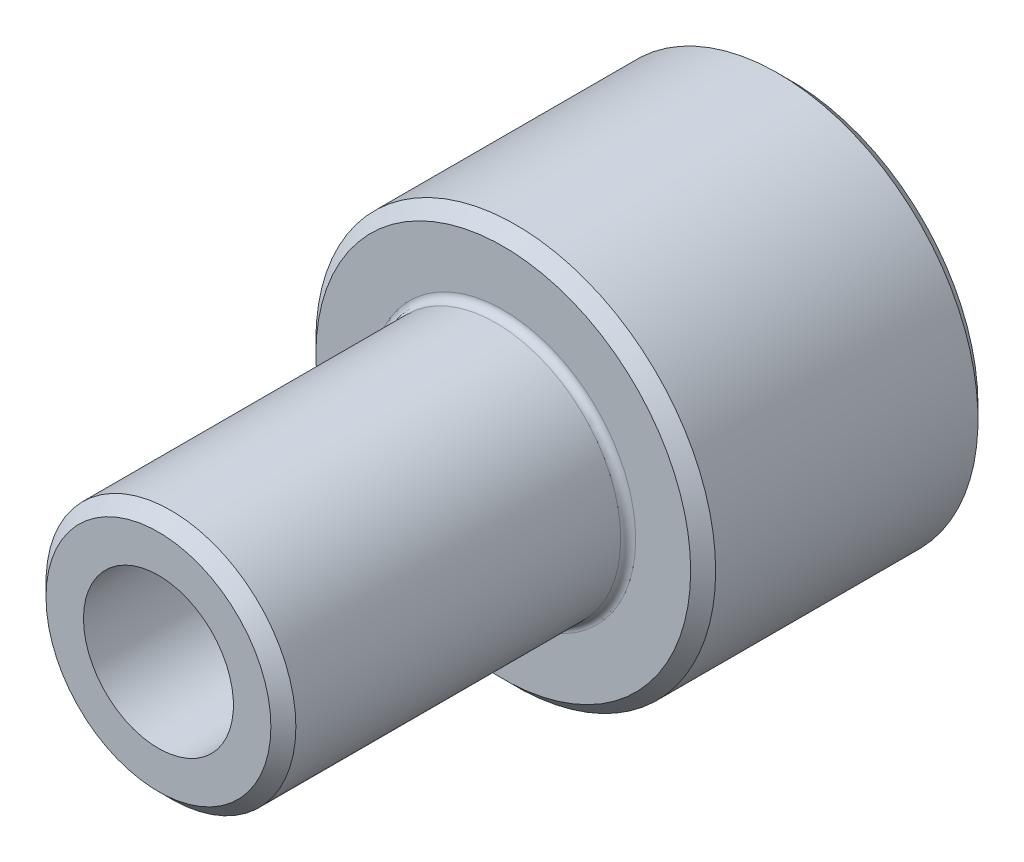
ISO-10303-21;
HEADER;
FILE_DESCRIPTION(('STEP AP214'),'2;1');
FILE_NAME('part.step','',(''),(''),'','','');
FILE_SCHEMA(('AUTOMOTIVE_DESIGN { 1 0 10303 214 1 1 1 1 }'));
ENDSEC;
DATA;
#1=APPLICATION_CONTEXT('core data for automotive mechanical design processes');
#2=APPLICATION_PROTOCOL_DEFINITION('international standard','automotive_design',2000,#1);
#3=PRODUCT_CONTEXT('',#1,'mechanical');
#4=PRODUCT('Part','Part','',(#3));
#5=PRODUCT_RELATED_PRODUCT_CATEGORY('part','',(#4));
#6=PRODUCT_DEFINITION_FORMATION('','',#4);
#7=PRODUCT_DEFINITION_CONTEXT('part definition',#1,'design');
#8=PRODUCT_DEFINITION('design','',#6,#7);
#9=PRODUCT_DEFINITION_SHAPE('','',#8);
#10=(LENGTH_UNIT() NAMED_UNIT(*) SI_UNIT(.MILLI.,.METRE.));
#11=(NAMED_UNIT(*) PLANE_ANGLE_UNIT() SI_UNIT($,.RADIAN.));
#12=(NAMED_UNIT(*) SI_UNIT($,.STERADIAN.) SOLID_ANGLE_UNIT());
#13=UNCERTAINTY_MEASURE_WITH_UNIT(LENGTH_MEASURE(1.E-05),#10,'distance_accuracy_value','');
#14=(GEOMETRIC_REPRESENTATION_CONTEXT(3) GLOBAL_UNCERTAINTY_ASSIGNED_CONTEXT((#13)) GLOBAL_UNIT_ASSIGNED_CONTEXT((#10,
#11,#12)) REPRESENTATION_CONTEXT('',''));
#15=CARTESIAN_POINT('',(0.,0.,0.));
#16=DIRECTION('',(0.,0.,1.));
#17=DIRECTION('',(1.,0.,0.));
#18=AXIS2_PLACEMENT_3D('',#15,#16,#17);
#19=CARTESIAN_POINT('',(0.,0.,0.));
#20=DIRECTION('',(0.,0.,-1.));
#21=DIRECTION('',(-1.,0.,0.));
#22=AXIS2_PLACEMENT_3D('',#19,#20,#21);
#23=PLANE('',#22);
#24=CARTESIAN_POINT('',(0.,0.,0.));
#25=DIRECTION('',(0.,0.,-1.));
#26=DIRECTION('',(-1.,0.,0.));
#27=AXIS2_PLACEMENT_3D('',#24,#25,#26);
#28=CIRCLE('',#27,7.5);
#29=CARTESIAN_POINT('',(-7.5,0.,0.));
#30=VERTEX_POINT('',#29);
#31=EDGE_CURVE('E41',#30,#30,#28,.T.);
#32=ORIENTED_EDGE('',*,*,#31,.T.);
#33=EDGE_LOOP('',(#32));
#34=FACE_BOUND('',#33,.T.);
#35=CARTESIAN_POINT('',(0.,0.,0.));
#36=DIRECTION('',(0.,0.,-1.));
#37=DIRECTION('',(-1.,0.,0.));
#38=AXIS2_PLACEMENT_3D('',#35,#36,#37);
#39=CIRCLE('',#38,3.);
#40=CARTESIAN_POINT('',(-3.,0.,0.));
#41=VERTEX_POINT('',#40);
#42=EDGE_CURVE('E45',#41,#41,#39,.T.);
#43=ORIENTED_EDGE('',*,*,#42,.F.);
#44=EDGE_LOOP('',(#43));
#45=FACE_BOUND('',#44,.T.);
#46=ADVANCED_FACE('F12',(#34,#45),#23,.T.);
#47=CARTESIAN_POINT('',(0.,0.,0.));
#48=DIRECTION('',(0.,0.,-1.));
#49=DIRECTION('',(-1.,0.,0.));
#50=AXIS2_PLACEMENT_3D('',#47,#48,#49);
#51=CYLINDRICAL_SURFACE('',#50,8.);
#52=CARTESIAN_POINT('',(0.,0.,0.5));
#53=DIRECTION('',(0.,0.,-1.));
#54=DIRECTION('',(-1.,0.,0.));
#55=AXIS2_PLACEMENT_3D('',#52,#53,#54);
#56=CIRCLE('',#55,8.);
#57=CARTESIAN_POINT('',(-8.,0.,0.5));
#58=VERTEX_POINT('',#57);
#59=EDGE_CURVE('E35',#58,#58,#56,.F.);
#60=ORIENTED_EDGE('',*,*,#59,.T.);
#61=EDGE_LOOP('',(#60));
#62=FACE_BOUND('',#61,.T.);
#63=CARTESIAN_POINT('',(0.,0.,11.));
#64=DIRECTION('',(0.,0.,1.));
#65=DIRECTION('',(1.,0.,0.));
#66=AXIS2_PLACEMENT_3D('',#63,#64,#65);
#67=CIRCLE('',#66,8.);
#68=CARTESIAN_POINT('',(8.,0.,11.));
#69=VERTEX_POINT('',#68);
#70=EDGE_CURVE('E38',#69,#69,#67,.F.);
#71=ORIENTED_EDGE('',*,*,#70,.T.);
#72=EDGE_LOOP('',(#71));
#73=FACE_BOUND('',#72,.T.);
#74=ADVANCED_FACE('F61',(#62,#73),#51,.T.);
#75=CARTESIAN_POINT('',(0.,8.,11.5));
#76=DIRECTION('',(0.,0.,1.));
#77=DIRECTION('',(1.,0.,0.));
#78=AXIS2_PLACEMENT_3D('',#75,#76,#77);
#79=PLANE('',#78);
#80=CARTESIAN_POINT('',(0.,0.,11.5));
#81=DIRECTION('',(0.,0.,1.));
#82=DIRECTION('',(1.,0.,0.));
#83=AXIS2_PLACEMENT_3D('',#80,#81,#82);
#84=CIRCLE('',#83,5.3);
#85=CARTESIAN_POINT('',(5.3,0.,11.5));
#86=VERTEX_POINT('',#85);
#87=EDGE_CURVE('E19',#86,#86,#84,.F.);
#88=ORIENTED_EDGE('',*,*,#87,.T.);
#89=EDGE_LOOP('',(#88));
#90=FACE_BOUND('',#89,.T.);
#91=CARTESIAN_POINT('',(0.,0.,11.5));
#92=DIRECTION('',(0.,0.,1.));
#93=DIRECTION('',(1.,0.,0.));
#94=AXIS2_PLACEMENT_3D('',#91,#92,#93);
#95=CIRCLE('',#94,7.5);
#96=CARTESIAN_POINT('',(7.5,0.,11.5));
#97=VERTEX_POINT('',#96);
#98=EDGE_CURVE('E32',#97,#97,#95,.T.);
#99=ORIENTED_EDGE('',*,*,#98,.T.);
#100=EDGE_LOOP('',(#99));
#101=FACE_BOUND('',#100,.T.);
#102=ADVANCED_FACE('F69',(#90,#101),#79,.T.);
#103=CARTESIAN_POINT('',(0.,0.,0.));
#104=DIRECTION('',(0.,0.,-1.));
#105=DIRECTION('',(-1.,0.,0.));
#106=AXIS2_PLACEMENT_3D('',#103,#104,#105);
#107=CYLINDRICAL_SURFACE('',#106,5.);
#108=CARTESIAN_POINT('',(0.,0.,11.8));
#109=DIRECTION('',(0.,0.,1.));
#110=DIRECTION('',(1.,0.,0.));
#111=AXIS2_PLACEMENT_3D('',#108,#109,#110);
#112=CIRCLE('',#111,5.);
#113=CARTESIAN_POINT('',(5.,0.,11.8));
#114=VERTEX_POINT('',#113);
#115=EDGE_CURVE('E8',#114,#114,#112,.T.);
#116=ORIENTED_EDGE('',*,*,#115,.T.);
#117=EDGE_LOOP('',(#116));
#118=FACE_BOUND('',#117,.T.);
#119=CARTESIAN_POINT('',(0.,0.,24.8));
#120=DIRECTION('',(0.,0.,1.));
#121=DIRECTION('',(1.,0.,0.));
#122=AXIS2_PLACEMENT_3D('',#119,#120,#121);
#123=CIRCLE('',#122,5.);
#124=CARTESIAN_POINT('',(5.,0.,24.8));
#125=VERTEX_POINT('',#124);
#126=EDGE_CURVE('E27',#125,#125,#123,.F.);
#127=ORIENTED_EDGE('',*,*,#126,.T.);
#128=EDGE_LOOP('',(#127));
#129=FACE_BOUND('',#128,.T.);
#130=ADVANCED_FACE('F92',(#118,#129),#107,.T.);
#131=CARTESIAN_POINT('',(0.,5.,25.3));
#132=DIRECTION('',(0.,0.,1.));
#133=DIRECTION('',(1.,0.,0.));
#134=AXIS2_PLACEMENT_3D('',#131,#132,#133);
#135=PLANE('',#134);
#136=CARTESIAN_POINT('',(0.,0.,25.3));
#137=DIRECTION('',(0.,0.,1.));
#138=DIRECTION('',(1.,0.,0.));
#139=AXIS2_PLACEMENT_3D('',#136,#137,#138);
#140=CIRCLE('',#139,4.5);
#141=CARTESIAN_POINT('',(4.5,0.,25.3));
#142=VERTEX_POINT('',#141);
#143=EDGE_CURVE('E23',#142,#142,#140,.T.);
#144=ORIENTED_EDGE('',*,*,#143,.T.);
#145=EDGE_LOOP('',(#144));
#146=FACE_BOUND('',#145,.T.);
#147=CARTESIAN_POINT('',(0.,0.,25.3));
#148=DIRECTION('',(0.,0.,-1.));
#149=DIRECTION('',(-1.,0.,0.));
#150=AXIS2_PLACEMENT_3D('',#147,#148,#149);
#151=CIRCLE('',#150,3.);
#152=CARTESIAN_POINT('',(-3.,0.,25.3));
#153=VERTEX_POINT('',#152);
#154=EDGE_CURVE('E44',#153,#153,#151,.T.);
#155=ORIENTED_EDGE('',*,*,#154,.T.);
#156=EDGE_LOOP('',(#155));
#157=FACE_BOUND('',#156,.T.);
#158=ADVANCED_FACE('F51',(#146,#157),#135,.T.);
#159=CARTESIAN_POINT('',(0.,0.,25.3));
#160=DIRECTION('',(0.,0.,-1.));
#161=DIRECTION('',(-1.,0.,0.));
#162=AXIS2_PLACEMENT_3D('',#159,#160,#161);
#163=CYLINDRICAL_SURFACE('',#162,3.);
#164=ORIENTED_EDGE('',*,*,#154,.F.);
#165=EDGE_LOOP('',(#164));
#166=FACE_BOUND('',#165,.T.);
#167=ORIENTED_EDGE('',*,*,#42,.T.);
#168=EDGE_LOOP('',(#167));
#169=FACE_BOUND('',#168,.T.);
#170=ADVANCED_FACE('F53',(#166,#169),#163,.F.);
#171=CARTESIAN_POINT('',(0.,0.,0.));
#172=DIRECTION('',(0.,0.,1.));
#173=DIRECTION('',(1.,0.,0.));
#174=AXIS2_PLACEMENT_3D('',#171,#172,#173);
#175=CONICAL_SURFACE('',#174,7.5,0.785398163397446);
#176=ORIENTED_EDGE('',*,*,#59,.F.);
#177=EDGE_LOOP('',(#176));
#178=FACE_BOUND('',#177,.T.);
#179=ORIENTED_EDGE('',*,*,#31,.F.);
#180=EDGE_LOOP('',(#179));
#181=FACE_BOUND('',#180,.T.);
#182=ADVANCED_FACE('F56',(#178,#181),#175,.T.);
#183=CARTESIAN_POINT('',(0.,0.,11.));
#184=DIRECTION('',(0.,0.,-1.));
#185=DIRECTION('',(-1.,0.,0.));
#186=AXIS2_PLACEMENT_3D('',#183,#184,#185);
#187=CONICAL_SURFACE('',#186,8.,0.78539816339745);
#188=ORIENTED_EDGE('',*,*,#98,.F.);
#189=EDGE_LOOP('',(#188));
#190=FACE_BOUND('',#189,.T.);
#191=ORIENTED_EDGE('',*,*,#70,.F.);
#192=EDGE_LOOP('',(#191));
#193=FACE_BOUND('',#192,.T.);
#194=ADVANCED_FACE('F76',(#190,#193),#187,.T.);
#195=CARTESIAN_POINT('',(0.,0.,24.8));
#196=DIRECTION('',(0.,0.,-1.));
#197=DIRECTION('',(-1.,0.,0.));
#198=AXIS2_PLACEMENT_3D('',#195,#196,#197);
#199=CONICAL_SURFACE('',#198,5.,0.785398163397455);
#200=ORIENTED_EDGE('',*,*,#143,.F.);
#201=EDGE_LOOP('',(#200));
#202=FACE_BOUND('',#201,.T.);
#203=ORIENTED_EDGE('',*,*,#126,.F.);
#204=EDGE_LOOP('',(#203));
#205=FACE_BOUND('',#204,.T.);
#206=ADVANCED_FACE('F79',(#202,#205),#199,.T.);
#207=CARTESIAN_POINT('',(0.,0.,11.8));
#208=DIRECTION('',(0.,0.,1.));
#209=DIRECTION('',(1.,0.,0.));
#210=AXIS2_PLACEMENT_3D('',#207,#208,#209);
#211=TOROIDAL_SURFACE('',#210,5.3,0.3);
#212=ORIENTED_EDGE('',*,*,#115,.F.);
#213=EDGE_LOOP('',(#212));
#214=FACE_BOUND('',#213,.T.);
#215=ORIENTED_EDGE('',*,*,#87,.F.);
#216=EDGE_LOOP('',(#215));
#217=FACE_BOUND('',#216,.T.);
#218=ADVANCED_FACE('F14',(#214,#217),#211,.F.);
#219=CLOSED_SHELL('',(#46,#74,#102,#130,#158,#170,#182,#194,#206,#218));
#220=MANIFOLD_SOLID_BREP('B1',#219);
#221=ADVANCED_BREP_SHAPE_REPRESENTATION('',(#18,#220),#14);
#222=SHAPE_DEFINITION_REPRESENTATION(#9,#221);
ENDSEC;
END-ISO-10303-21;
